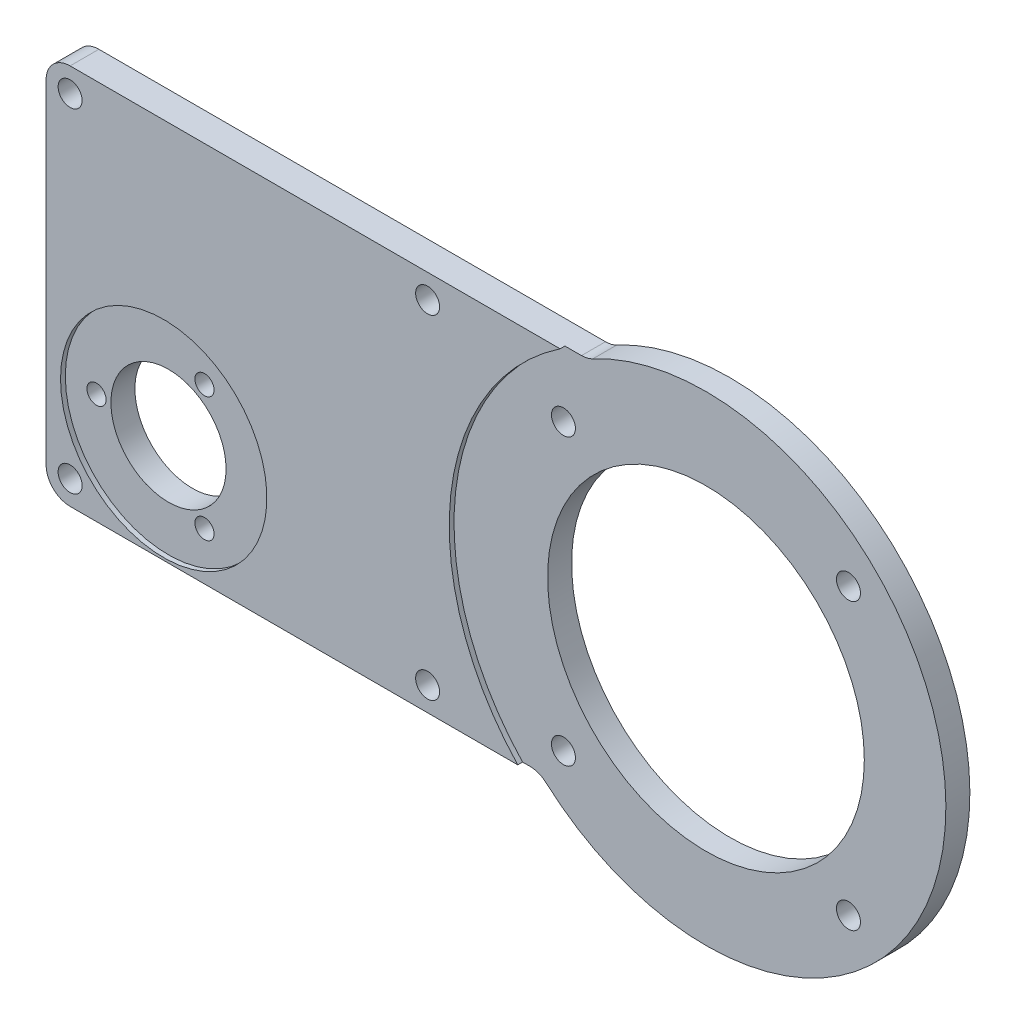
from build123d import *

# Parameters (mm, degrees)
EXTRUSION1_DEPTH                 = 12
ENL_V_START                      = -2
ENL_V_MAT_EXTRU_1_DEPTH          = 2
ESQUISSE3_R                      = 43
ENL_V_MAT_EXTRU_2_DEPTH          = 2
DIAM_TRE_DU_PER_AGE_M10_0_10_1_D = 10
DIAM_TRE_DU_PER_AGE_M10_0_10_2_D = 10
DIAM_TRE_DU_PER_AGE_M10_0_10_3_D = 10
DIAM_TRE_DU_PER_AGE_M10_0_10_4_D = 10
PER_AGE1_D                       = 132
DIAM_TRE_DU_PER_AGE_M10_0_10_5_D = 10
DIAM_TRE_DU_PER_AGE_M10_0_10_6_D = 10
DIAM_TRE_DU_PER_AGE_M8_0_8_1_D   = 8
DIAM_TRE_DU_PER_AGE_M8_0_8_2_D   = 8
DIAM_TRE_DU_PER_AGE_M8_0_8_3_D   = 8
D_GAGEMENT_M421_D                = 48
DIAM_TRE_DU_PER_AGE_M10_0_10_7_D = 10
DIAM_TRE_DU_PER_AGE_M10_0_10_8_D = 10


with BuildPart() as part:
    # Esquisse1 → Extrusion1 (new body)
    with BuildSketch(Plane(origin=(0, 0, 0), x_dir=(-1, 0, 0), z_dir=(0, 0, -1))):
        with BuildLine():
            Line((73.321211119, -72), (263, -72))
            ThreePointArc((263, -72), (270.071067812, -69.071067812), (273, -62))
            Line((273, -62), (273, 77))
            ThreePointArc((273, 77), (270.071067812, 84.071067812), (263, 87))
            Line((263, 87), (51.874849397, 87))
            ThreePointArc((51.874849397, 87), (49.443987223, 87.29995314), (47.158953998, 88.181818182))
            ThreePointArc((47.158953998, 88.181818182), (-99.289889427, -11.896127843), (66.655646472, -74.545454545))
            ThreePointArc((66.655646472, -74.545454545), (69.753680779, -72.65801267), (73.321211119, -72))
        make_face()
    extrude(amount=-EXTRUSION1_DEPTH)

    # Esquisse2 → Enl_v. mat.-Extru.1 (cut)
    with BuildSketch(Plane.XY.offset(12).offset(ENL_V_START)):
        with BuildLine():
            Line((-51.874849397, 87), (-58.787753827, 87))
            ThreePointArc((-58.787753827, 87), (-104.359806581, 11.577165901), (-76.426435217, -72))
            Line((-76.426435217, -72), (-73.321211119, -72))
            ThreePointArc((-73.321211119, -72), (-69.753680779, -72.65801267), (-66.655646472, -74.545454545))
            ThreePointArc((-66.655646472, -74.545454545), (99.289889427, -11.896127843), (-47.158953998, 88.181818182))
            ThreePointArc((-47.158953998, 88.181818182), (-49.443987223, 87.29995314), (-51.874849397, 87))
        make_face()
    extrude(amount=ENL_V_MAT_EXTRU_1_DEPTH, mode=Mode.SUBTRACT)

    # Esquisse3 → Enl_v. mat.-Extru.2 (cut)
    with BuildSketch(Plane.XY.offset(12)):
        with Locations(Location((-224, -28, 0), (0, 0, 180))):
            Circle(ESQUISSE3_R)
    extrude(amount=-ENL_V_MAT_EXTRU_2_DEPTH, mode=Mode.SUBTRACT)

    # Diam_tre du per_age M10.0 _10_1 (through all)
    with Locations(Plane.XY.offset(10)):
        with Locations((59.39696962, -59.39696962)):
            Hole(DIAM_TRE_DU_PER_AGE_M10_0_10_1_D / 2)

    # Diam_tre du per_age M10.0 _10_2 (through all)
    with Locations(Plane.XY.offset(10)):
        with Locations((59.39696962, 59.39696962)):
            Hole(DIAM_TRE_DU_PER_AGE_M10_0_10_2_D / 2)

    # Diam_tre du per_age M10.0 _10_3 (through all)
    with Locations(Plane.XY.offset(12)):
        with Locations((-114, 77)):
            Hole(DIAM_TRE_DU_PER_AGE_M10_0_10_3_D / 2)

    # Diam_tre du per_age M10.0 _10_4 (through all)
    with Locations(Plane.XY.offset(10)):
        with Locations((-59.39696962, 59.39696962)):
            Hole(DIAM_TRE_DU_PER_AGE_M10_0_10_4_D / 2)

    # Per_age1 (through all)
    with Locations(Plane.XY.offset(10)):
        with Locations((0, 0)):
            Hole(PER_AGE1_D / 2)

    # Diam_tre du per_age M10.0 _10_5 (through all)
    with Locations(Plane.XY.offset(10)):
        with Locations((-59.39696962, -59.39696962)):
            Hole(DIAM_TRE_DU_PER_AGE_M10_0_10_5_D / 2)

    # Diam_tre du per_age M10.0 _10_6 (through all)
    with Locations(Plane.XY.offset(12)):
        with Locations((-114, -62)):
            Hole(DIAM_TRE_DU_PER_AGE_M10_0_10_6_D / 2)

    # Diam_tre du per_age M8.0 _8_1 (through all)
    with Locations(Plane.XY.offset(10)):
        with Locations((-209, -2.019237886)):
            Hole(DIAM_TRE_DU_PER_AGE_M8_0_8_1_D / 2)

    # Diam_tre du per_age M8.0 _8_2 (through all)
    with Locations(Plane.XY.offset(10)):
        with Locations((-254, -28)):
            Hole(DIAM_TRE_DU_PER_AGE_M8_0_8_2_D / 2)

    # Diam_tre du per_age M8.0 _8_3 (through all)
    with Locations(Plane.XY.offset(10)):
        with Locations((-209, -53.980762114)):
            Hole(DIAM_TRE_DU_PER_AGE_M8_0_8_3_D / 2)

    # D_gagement M421 (through all)
    with Locations(Plane.XY.offset(10)):
        with Locations((-224, -28)):
            Hole(D_GAGEMENT_M421_D / 2)

    # Diam_tre du per_age M10.0 _10_7 (through all)
    with Locations(Plane.XY.offset(12)):
        with Locations((-263, -62)):
            Hole(DIAM_TRE_DU_PER_AGE_M10_0_10_7_D / 2)

    # Diam_tre du per_age M10.0 _10_8 (through all)
    with Locations(Plane.XY.offset(12)):
        with Locations((-263, 77)):
            Hole(DIAM_TRE_DU_PER_AGE_M10_0_10_8_D / 2)


solid = part.part
